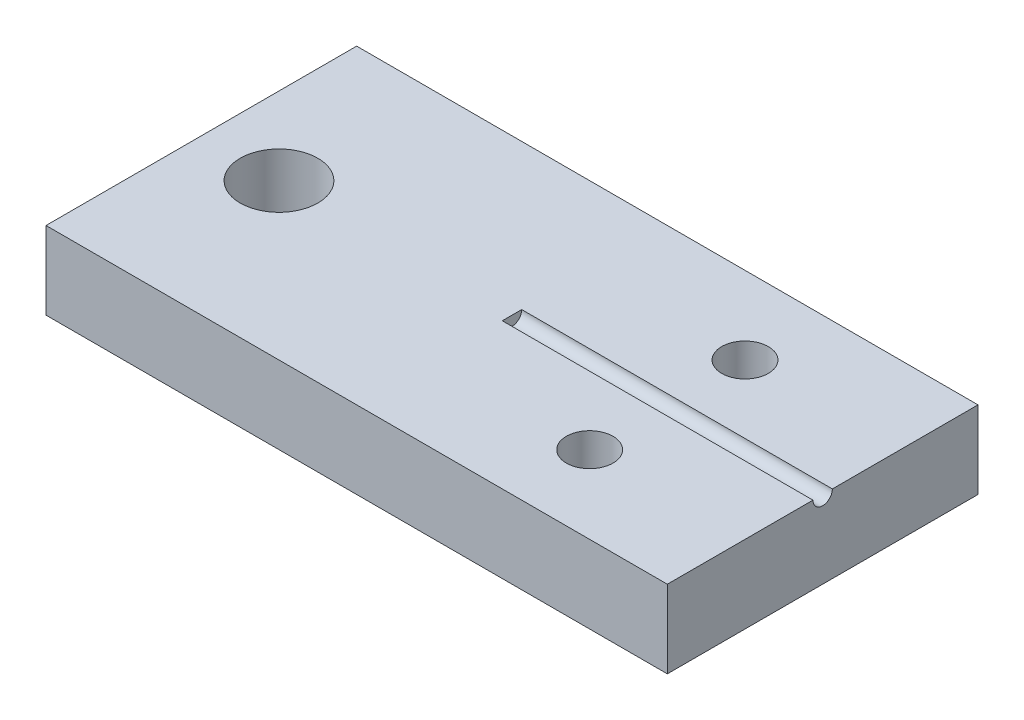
ISO-10303-21;
HEADER;
FILE_DESCRIPTION(('STEP AP214'),'2;1');
FILE_NAME('part.step','',(''),(''),'','','');
FILE_SCHEMA(('AUTOMOTIVE_DESIGN { 1 0 10303 214 1 1 1 1 }'));
ENDSEC;
DATA;
#1=APPLICATION_CONTEXT('core data for automotive mechanical design processes');
#2=APPLICATION_PROTOCOL_DEFINITION('international standard','automotive_design',2000,#1);
#3=PRODUCT_CONTEXT('',#1,'mechanical');
#4=PRODUCT('Part','Part','',(#3));
#5=PRODUCT_RELATED_PRODUCT_CATEGORY('part','',(#4));
#6=PRODUCT_DEFINITION_FORMATION('','',#4);
#7=PRODUCT_DEFINITION_CONTEXT('part definition',#1,'design');
#8=PRODUCT_DEFINITION('design','',#6,#7);
#9=PRODUCT_DEFINITION_SHAPE('','',#8);
#10=(LENGTH_UNIT() NAMED_UNIT(*) SI_UNIT(.MILLI.,.METRE.));
#11=(NAMED_UNIT(*) PLANE_ANGLE_UNIT() SI_UNIT($,.RADIAN.));
#12=(NAMED_UNIT(*) SI_UNIT($,.STERADIAN.) SOLID_ANGLE_UNIT());
#13=UNCERTAINTY_MEASURE_WITH_UNIT(LENGTH_MEASURE(1.E-05),#10,'distance_accuracy_value','');
#14=(GEOMETRIC_REPRESENTATION_CONTEXT(3) GLOBAL_UNCERTAINTY_ASSIGNED_CONTEXT((#13)) GLOBAL_UNIT_ASSIGNED_CONTEXT((#10,
#11,#12)) REPRESENTATION_CONTEXT('',''));
#15=CARTESIAN_POINT('',(0.,0.,0.));
#16=DIRECTION('',(0.,0.,1.));
#17=DIRECTION('',(1.,0.,0.));
#18=AXIS2_PLACEMENT_3D('',#15,#16,#17);
#19=CARTESIAN_POINT('',(0.,6.35,0.));
#20=DIRECTION('',(0.,-1.,0.));
#21=DIRECTION('',(0.,0.,-1.));
#22=AXIS2_PLACEMENT_3D('',#19,#20,#21);
#23=PLANE('',#22);
#24=DIRECTION('',(0.,0.,1.));
#25=VECTOR('',#24,1.);
#26=CARTESIAN_POINT('',(25.4,6.35,0.));
#27=LINE('',#26,#25);
#28=CARTESIAN_POINT('',(25.4,6.35,-13.49375));
#29=VERTEX_POINT('',#28);
#30=CARTESIAN_POINT('',(25.4,6.35,-11.90625));
#31=VERTEX_POINT('',#30);
#32=EDGE_CURVE('E11',#29,#31,#27,.T.);
#33=ORIENTED_EDGE('',*,*,#32,.F.);
#34=DIRECTION('',(1.,0.,0.));
#35=VECTOR('',#34,1.);
#36=CARTESIAN_POINT('',(25.4,6.35,-13.49375));
#37=LINE('',#36,#35);
#38=CARTESIAN_POINT('',(50.8,6.35,-13.49375));
#39=VERTEX_POINT('',#38);
#40=EDGE_CURVE('E95',#29,#39,#37,.T.);
#41=ORIENTED_EDGE('',*,*,#40,.T.);
#42=DIRECTION('',(0.,0.,-1.));
#43=VECTOR('',#42,1.);
#44=CARTESIAN_POINT('',(50.8,6.35,0.));
#45=LINE('',#44,#43);
#46=CARTESIAN_POINT('',(50.8,6.35,-25.4));
#47=VERTEX_POINT('',#46);
#48=EDGE_CURVE('E133',#39,#47,#45,.T.);
#49=ORIENTED_EDGE('',*,*,#48,.T.);
#50=DIRECTION('',(-1.,0.,0.));
#51=VECTOR('',#50,1.);
#52=CARTESIAN_POINT('',(0.,6.35,-25.4));
#53=LINE('',#52,#51);
#54=CARTESIAN_POINT('',(0.,6.35,-25.4));
#55=VERTEX_POINT('',#54);
#56=EDGE_CURVE('E58',#47,#55,#53,.T.);
#57=ORIENTED_EDGE('',*,*,#56,.T.);
#58=DIRECTION('',(0.,0.,1.));
#59=VECTOR('',#58,1.);
#60=CARTESIAN_POINT('',(0.,6.35,0.));
#61=LINE('',#60,#59);
#62=CARTESIAN_POINT('',(0.,6.35,0.));
#63=VERTEX_POINT('',#62);
#64=EDGE_CURVE('E130',#55,#63,#61,.T.);
#65=ORIENTED_EDGE('',*,*,#64,.T.);
#66=DIRECTION('',(1.,0.,0.));
#67=VECTOR('',#66,1.);
#68=CARTESIAN_POINT('',(0.,6.35,0.));
#69=LINE('',#68,#67);
#70=CARTESIAN_POINT('',(50.8,6.35,0.));
#71=VERTEX_POINT('',#70);
#72=EDGE_CURVE('E87',#63,#71,#69,.T.);
#73=ORIENTED_EDGE('',*,*,#72,.T.);
#74=CARTESIAN_POINT('',(50.8,6.35,-11.90625));
#75=VERTEX_POINT('',#74);
#76=EDGE_CURVE('E109',#71,#75,#45,.T.);
#77=ORIENTED_EDGE('',*,*,#76,.T.);
#78=DIRECTION('',(1.,0.,0.));
#79=VECTOR('',#78,1.);
#80=CARTESIAN_POINT('',(25.4,6.35,-11.90625));
#81=LINE('',#80,#79);
#82=EDGE_CURVE('E49',#75,#31,#81,.F.);
#83=ORIENTED_EDGE('',*,*,#82,.T.);
#84=EDGE_LOOP('',(#33,#41,#49,#57,#65,#73,#77,#83));
#85=FACE_BOUND('',#84,.T.);
#86=CARTESIAN_POINT('',(38.1,6.35,-6.35));
#87=DIRECTION('',(0.,1.,0.));
#88=DIRECTION('',(0.,0.,1.));
#89=AXIS2_PLACEMENT_3D('',#86,#87,#88);
#90=CIRCLE('',#89,1.905);
#91=CARTESIAN_POINT('',(38.1,6.35,-4.445));
#92=VERTEX_POINT('',#91);
#93=EDGE_CURVE('E124',#92,#92,#90,.T.);
#94=ORIENTED_EDGE('',*,*,#93,.F.);
#95=EDGE_LOOP('',(#94));
#96=FACE_BOUND('',#95,.T.);
#97=CARTESIAN_POINT('',(38.1,6.35,-19.05));
#98=DIRECTION('',(0.,1.,0.));
#99=DIRECTION('',(0.,0.,1.));
#100=AXIS2_PLACEMENT_3D('',#97,#98,#99);
#101=CIRCLE('',#100,1.905);
#102=CARTESIAN_POINT('',(38.1,6.35,-17.145));
#103=VERTEX_POINT('',#102);
#104=EDGE_CURVE('E118',#103,#103,#101,.T.);
#105=ORIENTED_EDGE('',*,*,#104,.F.);
#106=EDGE_LOOP('',(#105));
#107=FACE_BOUND('',#106,.T.);
#108=CARTESIAN_POINT('',(6.35,6.35,-12.7));
#109=DIRECTION('',(0.,1.,0.));
#110=DIRECTION('',(0.,0.,1.));
#111=AXIS2_PLACEMENT_3D('',#108,#109,#110);
#112=CIRCLE('',#111,3.175);
#113=CARTESIAN_POINT('',(6.35,6.35,-9.525));
#114=VERTEX_POINT('',#113);
#115=EDGE_CURVE('E112',#114,#114,#112,.T.);
#116=ORIENTED_EDGE('',*,*,#115,.F.);
#117=EDGE_LOOP('',(#116));
#118=FACE_BOUND('',#117,.T.);
#119=ADVANCED_FACE('F34',(#85,#96,#107,#118),#23,.F.);
#120=CARTESIAN_POINT('',(0.,0.,0.));
#121=DIRECTION('',(0.,-1.,0.));
#122=DIRECTION('',(0.,0.,-1.));
#123=AXIS2_PLACEMENT_3D('',#120,#121,#122);
#124=PLANE('',#123);
#125=CARTESIAN_POINT('',(38.1,0.,-19.05));
#126=DIRECTION('',(0.,1.,0.));
#127=DIRECTION('',(0.,0.,1.));
#128=AXIS2_PLACEMENT_3D('',#125,#126,#127);
#129=CIRCLE('',#128,1.905);
#130=CARTESIAN_POINT('',(38.1,0.,-17.145));
#131=VERTEX_POINT('',#130);
#132=EDGE_CURVE('E115',#131,#131,#129,.T.);
#133=ORIENTED_EDGE('',*,*,#132,.T.);
#134=EDGE_LOOP('',(#133));
#135=FACE_BOUND('',#134,.T.);
#136=DIRECTION('',(0.,0.,1.));
#137=VECTOR('',#136,1.);
#138=CARTESIAN_POINT('',(0.,0.,0.));
#139=LINE('',#138,#137);
#140=CARTESIAN_POINT('',(0.,0.,-25.4));
#141=VERTEX_POINT('',#140);
#142=CARTESIAN_POINT('',(0.,0.,0.));
#143=VERTEX_POINT('',#142);
#144=EDGE_CURVE('E127',#141,#143,#139,.T.);
#145=ORIENTED_EDGE('',*,*,#144,.F.);
#146=DIRECTION('',(-1.,0.,0.));
#147=VECTOR('',#146,1.);
#148=CARTESIAN_POINT('',(0.,0.,-25.4));
#149=LINE('',#148,#147);
#150=CARTESIAN_POINT('',(50.8,0.,-25.4));
#151=VERTEX_POINT('',#150);
#152=EDGE_CURVE('E79',#151,#141,#149,.T.);
#153=ORIENTED_EDGE('',*,*,#152,.F.);
#154=DIRECTION('',(0.,0.,-1.));
#155=VECTOR('',#154,1.);
#156=CARTESIAN_POINT('',(50.8,0.,0.));
#157=LINE('',#156,#155);
#158=CARTESIAN_POINT('',(50.8,0.,0.));
#159=VERTEX_POINT('',#158);
#160=EDGE_CURVE('E141',#159,#151,#157,.T.);
#161=ORIENTED_EDGE('',*,*,#160,.F.);
#162=DIRECTION('',(1.,0.,0.));
#163=VECTOR('',#162,1.);
#164=CARTESIAN_POINT('',(0.,0.,0.));
#165=LINE('',#164,#163);
#166=EDGE_CURVE('E139',#143,#159,#165,.T.);
#167=ORIENTED_EDGE('',*,*,#166,.F.);
#168=EDGE_LOOP('',(#145,#153,#161,#167));
#169=FACE_BOUND('',#168,.T.);
#170=CARTESIAN_POINT('',(38.1,0.,-6.35));
#171=DIRECTION('',(0.,1.,0.));
#172=DIRECTION('',(0.,0.,1.));
#173=AXIS2_PLACEMENT_3D('',#170,#171,#172);
#174=CIRCLE('',#173,1.905);
#175=CARTESIAN_POINT('',(38.1,0.,-4.445));
#176=VERTEX_POINT('',#175);
#177=EDGE_CURVE('E121',#176,#176,#174,.T.);
#178=ORIENTED_EDGE('',*,*,#177,.T.);
#179=EDGE_LOOP('',(#178));
#180=FACE_BOUND('',#179,.T.);
#181=CARTESIAN_POINT('',(6.35,0.,-12.7));
#182=DIRECTION('',(0.,1.,0.));
#183=DIRECTION('',(0.,0.,1.));
#184=AXIS2_PLACEMENT_3D('',#181,#182,#183);
#185=CIRCLE('',#184,3.175);
#186=CARTESIAN_POINT('',(6.35,0.,-9.525));
#187=VERTEX_POINT('',#186);
#188=EDGE_CURVE('E101',#187,#187,#185,.T.);
#189=ORIENTED_EDGE('',*,*,#188,.T.);
#190=EDGE_LOOP('',(#189));
#191=FACE_BOUND('',#190,.T.);
#192=ADVANCED_FACE('F162',(#135,#169,#180,#191),#124,.T.);
#193=CARTESIAN_POINT('',(0.,6.35,0.));
#194=DIRECTION('',(1.,0.,0.));
#195=DIRECTION('',(0.,0.,-1.));
#196=AXIS2_PLACEMENT_3D('',#193,#194,#195);
#197=PLANE('',#196);
#198=ORIENTED_EDGE('',*,*,#144,.T.);
#199=DIRECTION('',(0.,-1.,0.));
#200=VECTOR('',#199,1.);
#201=CARTESIAN_POINT('',(0.,6.35,0.));
#202=LINE('',#201,#200);
#203=EDGE_CURVE('E150',#63,#143,#202,.T.);
#204=ORIENTED_EDGE('',*,*,#203,.F.);
#205=ORIENTED_EDGE('',*,*,#64,.F.);
#206=DIRECTION('',(0.,-1.,0.));
#207=VECTOR('',#206,1.);
#208=CARTESIAN_POINT('',(0.,6.35,-25.4));
#209=LINE('',#208,#207);
#210=EDGE_CURVE('E136',#55,#141,#209,.T.);
#211=ORIENTED_EDGE('',*,*,#210,.T.);
#212=EDGE_LOOP('',(#198,#204,#205,#211));
#213=FACE_BOUND('',#212,.T.);
#214=ADVANCED_FACE('F36',(#213),#197,.F.);
#215=CARTESIAN_POINT('',(0.,6.35,0.));
#216=DIRECTION('',(0.,0.,-1.));
#217=DIRECTION('',(-1.,0.,0.));
#218=AXIS2_PLACEMENT_3D('',#215,#216,#217);
#219=PLANE('',#218);
#220=ORIENTED_EDGE('',*,*,#166,.T.);
#221=DIRECTION('',(0.,-1.,0.));
#222=VECTOR('',#221,1.);
#223=CARTESIAN_POINT('',(50.8,6.35,0.));
#224=LINE('',#223,#222);
#225=EDGE_CURVE('E147',#71,#159,#224,.T.);
#226=ORIENTED_EDGE('',*,*,#225,.F.);
#227=ORIENTED_EDGE('',*,*,#72,.F.);
#228=ORIENTED_EDGE('',*,*,#203,.T.);
#229=EDGE_LOOP('',(#220,#226,#227,#228));
#230=FACE_BOUND('',#229,.T.);
#231=ADVANCED_FACE('F160',(#230),#219,.F.);
#232=CARTESIAN_POINT('',(50.8,6.35,0.));
#233=DIRECTION('',(-1.,0.,0.));
#234=DIRECTION('',(0.,0.,1.));
#235=AXIS2_PLACEMENT_3D('',#232,#233,#234);
#236=PLANE('',#235);
#237=ORIENTED_EDGE('',*,*,#48,.F.);
#238=CARTESIAN_POINT('',(50.8,6.35,-12.7));
#239=DIRECTION('',(-1.,0.,0.));
#240=DIRECTION('',(0.,0.,1.));
#241=AXIS2_PLACEMENT_3D('',#238,#239,#240);
#242=CIRCLE('',#241,0.79375);
#243=EDGE_CURVE('E42',#39,#75,#242,.T.);
#244=ORIENTED_EDGE('',*,*,#243,.T.);
#245=ORIENTED_EDGE('',*,*,#76,.F.);
#246=ORIENTED_EDGE('',*,*,#225,.T.);
#247=ORIENTED_EDGE('',*,*,#160,.T.);
#248=DIRECTION('',(0.,-1.,0.));
#249=VECTOR('',#248,1.);
#250=CARTESIAN_POINT('',(50.8,6.35,-25.4));
#251=LINE('',#250,#249);
#252=EDGE_CURVE('E145',#47,#151,#251,.T.);
#253=ORIENTED_EDGE('',*,*,#252,.F.);
#254=EDGE_LOOP('',(#237,#244,#245,#246,#247,#253));
#255=FACE_BOUND('',#254,.T.);
#256=ADVANCED_FACE('F152',(#255),#236,.F.);
#257=CARTESIAN_POINT('',(0.,6.35,-25.4));
#258=DIRECTION('',(0.,0.,1.));
#259=DIRECTION('',(1.,0.,0.));
#260=AXIS2_PLACEMENT_3D('',#257,#258,#259);
#261=PLANE('',#260);
#262=ORIENTED_EDGE('',*,*,#152,.T.);
#263=ORIENTED_EDGE('',*,*,#210,.F.);
#264=ORIENTED_EDGE('',*,*,#56,.F.);
#265=ORIENTED_EDGE('',*,*,#252,.T.);
#266=EDGE_LOOP('',(#262,#263,#264,#265));
#267=FACE_BOUND('',#266,.T.);
#268=ADVANCED_FACE('F155',(#267),#261,.F.);
#269=CARTESIAN_POINT('',(38.1,6.35,-6.35));
#270=DIRECTION('',(0.,-1.,0.));
#271=DIRECTION('',(0.,0.,-1.));
#272=AXIS2_PLACEMENT_3D('',#269,#270,#271);
#273=CYLINDRICAL_SURFACE('',#272,1.905);
#274=ORIENTED_EDGE('',*,*,#93,.T.);
#275=EDGE_LOOP('',(#274));
#276=FACE_BOUND('',#275,.T.);
#277=ORIENTED_EDGE('',*,*,#177,.F.);
#278=EDGE_LOOP('',(#277));
#279=FACE_BOUND('',#278,.T.);
#280=ADVANCED_FACE('F181',(#276,#279),#273,.F.);
#281=CARTESIAN_POINT('',(38.1,6.35,-19.05));
#282=DIRECTION('',(0.,-1.,0.));
#283=DIRECTION('',(0.,0.,-1.));
#284=AXIS2_PLACEMENT_3D('',#281,#282,#283);
#285=CYLINDRICAL_SURFACE('',#284,1.905);
#286=ORIENTED_EDGE('',*,*,#104,.T.);
#287=EDGE_LOOP('',(#286));
#288=FACE_BOUND('',#287,.T.);
#289=ORIENTED_EDGE('',*,*,#132,.F.);
#290=EDGE_LOOP('',(#289));
#291=FACE_BOUND('',#290,.T.);
#292=ADVANCED_FACE('F173',(#288,#291),#285,.F.);
#293=CARTESIAN_POINT('',(6.35,6.35,-12.7));
#294=DIRECTION('',(0.,-1.,0.));
#295=DIRECTION('',(0.,0.,-1.));
#296=AXIS2_PLACEMENT_3D('',#293,#294,#295);
#297=CYLINDRICAL_SURFACE('',#296,3.175);
#298=ORIENTED_EDGE('',*,*,#115,.T.);
#299=EDGE_LOOP('',(#298));
#300=FACE_BOUND('',#299,.T.);
#301=ORIENTED_EDGE('',*,*,#188,.F.);
#302=EDGE_LOOP('',(#301));
#303=FACE_BOUND('',#302,.T.);
#304=ADVANCED_FACE('F171',(#300,#303),#297,.F.);
#305=CARTESIAN_POINT('',(25.4,6.35,-12.7));
#306=DIRECTION('',(1.,0.,0.));
#307=DIRECTION('',(0.,0.,-1.));
#308=AXIS2_PLACEMENT_3D('',#305,#306,#307);
#309=PLANE('',#308);
#310=ORIENTED_EDGE('',*,*,#32,.T.);
#311=CARTESIAN_POINT('',(25.4,6.35,-12.7));
#312=DIRECTION('',(1.,0.,0.));
#313=DIRECTION('',(0.,0.,-1.));
#314=AXIS2_PLACEMENT_3D('',#311,#312,#313);
#315=CIRCLE('',#314,0.79375);
#316=EDGE_CURVE('E98',#31,#29,#315,.T.);
#317=ORIENTED_EDGE('',*,*,#316,.T.);
#318=EDGE_LOOP('',(#310,#317));
#319=FACE_BOUND('',#318,.T.);
#320=ADVANCED_FACE('F104',(#319),#309,.T.);
#321=CARTESIAN_POINT('',(25.4,6.35,-12.7));
#322=DIRECTION('',(1.,0.,0.));
#323=DIRECTION('',(0.,0.,-1.));
#324=AXIS2_PLACEMENT_3D('',#321,#322,#323);
#325=CYLINDRICAL_SURFACE('',#324,0.79375);
#326=ORIENTED_EDGE('',*,*,#316,.F.);
#327=ORIENTED_EDGE('',*,*,#82,.F.);
#328=ORIENTED_EDGE('',*,*,#243,.F.);
#329=ORIENTED_EDGE('',*,*,#40,.F.);
#330=EDGE_LOOP('',(#326,#327,#328,#329));
#331=FACE_BOUND('',#330,.T.);
#332=ADVANCED_FACE('F97',(#331),#325,.F.);
#333=CLOSED_SHELL('',(#119,#192,#214,#231,#256,#268,#280,#292,#304,#320,#332));
#334=MANIFOLD_SOLID_BREP('B2',#333);
#335=ADVANCED_BREP_SHAPE_REPRESENTATION('',(#18,#334),#14);
#336=SHAPE_DEFINITION_REPRESENTATION(#9,#335);
ENDSEC;
END-ISO-10303-21;
